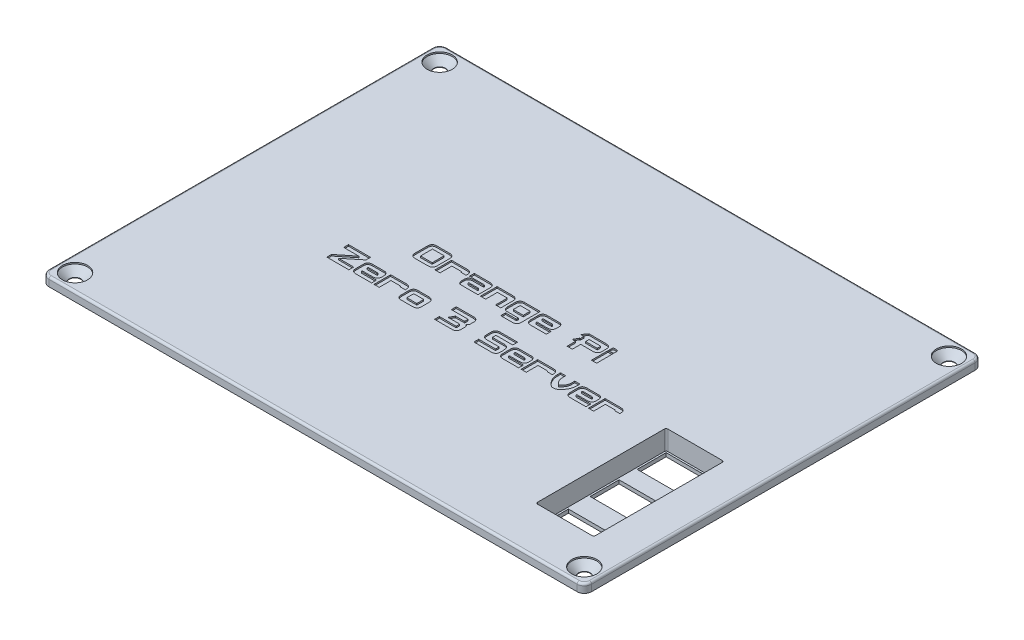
from build123d import *

# Parameters (mm, degrees)
SKETCH1_W                                    = 150
SKETCH1_H                                    = 110
BOSS_EXTRUDE1_DEPTH                          = 2.4
CSK_FOR_M3_HEX_SOCKET_COUNTERSUNK_HE_2_COUNT = 2
CSK_FOR_M3_HEX_SOCKET_COUNTERSUNK_HE_2_PITCH = 173.162582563
CSK_FOR_M3_HEX_SOCKET_COUNTERSUNK_HE_3_COUNT = 2
CSK_FOR_M3_HEX_SOCKET_COUNTERSUNK_HE_3_PITCH = 100.8
CSK_FOR_M3_HEX_SOCKET_COUNTERSUNK_HE_4_COUNT = 2
CSK_FOR_M3_HEX_SOCKET_COUNTERSUNK_HE_4_PITCH = 140.8
FILLET1_R                                    = 2
CUT_EXTRUDE1_DEPTH                           = 0.4
SKETCH7_W                                    = 20.8
SKETCH7_H                                    = 40.8
BOSS_EXTRUDE2_DEPTH                          = 4
SKETCH8_W                                    = 16
SKETCH8_H                                    = 36
CUT_EXTRUDE2_DEPTH                           = 5.4
FILLET2_R                                    = 0.5
SKETCH9_W                                    = 15
SKETCH9_H                                    = 8
CUT_EXTRUDE3_DEPTH                           = 187.120821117
FILLET3_R                                    = 0.5
FILLET5_R                                    = 0.6


with BuildPart() as part:
    # Sketch1 → Boss-Extrude1 (new body)
    with BuildSketch(Plane(origin=(0, 0, 0), x_dir=(1, 0, 0), z_dir=(0, 1, 0))):
        with Locations((75, 55)):
            Rectangle(SKETCH1_W, SKETCH1_H)
    extrude(amount=BOSS_EXTRUDE1_DEPTH)

    # Sketch4 → CSK for M3 Hex Socket Countersunk Head S (revolve, cut)
    with BuildSketch(Plane(origin=(4.6, 2.4, -105.4), x_dir=(0, 0, 1), z_dir=(1, 0, 0))):
        Polygon((0, 0), (0, 50.96137699), (1.6, 50), (1.6, 2.27), (3.47, 0.4), (3.47, 0), align=None)
    csk_for_m3_hex_socket_countersunk_head_s = revolve(axis=Axis((4.6, 8.75, -105.4), (0, -1, 0)), mode=Mode.SUBTRACT)

    # CSK for M3 Hex Socket Countersunk He 2: CSK for M3 Hex Socket Countersunk Head S ×2
    with Locations(*[Vector(0.8131086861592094, 0, 0.5821119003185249) * (i * CSK_FOR_M3_HEX_SOCKET_COUNTERSUNK_HE_2_PITCH) for i in range(1, CSK_FOR_M3_HEX_SOCKET_COUNTERSUNK_HE_2_COUNT)]):
        add(csk_for_m3_hex_socket_countersunk_head_s, mode=Mode.SUBTRACT)

    # CSK for M3 Hex Socket Countersunk He 3: CSK for M3 Hex Socket Countersunk Head S ×2
    with Locations(*[(0, 0, i * CSK_FOR_M3_HEX_SOCKET_COUNTERSUNK_HE_3_PITCH) for i in range(1, CSK_FOR_M3_HEX_SOCKET_COUNTERSUNK_HE_3_COUNT)]):
        add(csk_for_m3_hex_socket_countersunk_head_s, mode=Mode.SUBTRACT)

    # CSK for M3 Hex Socket Countersunk He 4: CSK for M3 Hex Socket Countersunk Head S ×2
    with Locations(*[(i * CSK_FOR_M3_HEX_SOCKET_COUNTERSUNK_HE_4_PITCH, 0, 0) for i in range(1, CSK_FOR_M3_HEX_SOCKET_COUNTERSUNK_HE_4_COUNT)]):
        add(csk_for_m3_hex_socket_countersunk_head_s, mode=Mode.SUBTRACT)

    # Fillet1
    fillet1_edges = [part.edges().sort_by_distance(p)[0] for p in [
        (0, 1.2, -110),
        (150, 1.2, -110),
        (150, 1.2, 0),
        (0, 1.2, 0),
    ]]
    fillet(fillet1_edges, radius=FILLET1_R)

    # Sketch5 → Cut-Extrude1 (cut)
    # profile 1 of 20: a face of its own
    with BuildSketch(Plane(origin=(0, 2.4, 0), x_dir=(1, 0, 0), z_dir=(0, 1, 0))):
        with BuildLine():
            add(Edge.make_bspline(
                [(53.025298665, 56.252283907), (53.02431657, 56.201632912), (53.022410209, 56.103313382), (53.004941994, 55.960931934), (52.978549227, 55.82831569), (52.942534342, 55.705008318), (52.894259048, 55.592174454), (52.836776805, 55.488272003), (52.767236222, 55.395220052), (52.6881135, 55.311528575), (52.598170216, 55.237857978), (52.498368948, 55.172517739), (52.386700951, 55.119959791), (52.26569426, 55.076222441), (52.134760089, 55.040401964), (51.992372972, 55.01821045), (51.840409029, 55.001373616), (51.735587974, 55.000466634), (51.681658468, 55)],
                knots=[0, 0, 0, 0, 1.154766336, 2.241537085, 3.266234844, 4.23644993, 5.165242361, 6.059848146, 6.938161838, 7.807328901, 8.680166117, 9.584103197, 10.520790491, 11.487527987, 12.516506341, 13.610866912, 14.770812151, 16, 16, 16, 16], degree=3))
            Line((51.681658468, 55), (48.189037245, 55))
            add(Edge.make_bspline(
                [(48.189037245, 55), (48.138381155, 55.000439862), (48.040556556, 55.001289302), (47.898902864, 55.018277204), (47.766293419, 55.040485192), (47.643878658, 55.076494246), (47.530502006, 55.11958207), (47.426637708, 55.172978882), (47.333891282, 55.238231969), (47.24994916, 55.31215746), (47.174697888, 55.394841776), (47.111687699, 55.489384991), (47.055887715, 55.591840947), (47.013391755, 55.705805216), (46.977226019, 55.82811152), (46.954838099, 55.961203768), (46.938463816, 56.103368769), (46.936407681, 56.201633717), (46.935347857, 56.252283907)],
                knots=[0, 0, 0, 0, 1.196021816, 2.309699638, 3.367160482, 4.369225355, 5.318990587, 6.230032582, 7.120600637, 7.991198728, 8.869155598, 9.753440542, 10.669646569, 11.619411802, 12.621476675, 13.678937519, 14.803619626, 16, 16, 16, 16], degree=3))
            Line((46.935347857, 56.252283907), (46.935347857, 59.740688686))
            add(Edge.make_bspline(
                [(46.935347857, 59.740688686), (46.935783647, 59.791814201), (46.936625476, 59.890574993), (46.953682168, 60.033611), (46.97558152, 60.167242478), (47.012195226, 60.29039228), (47.05450206, 60.404564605), (47.108802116, 60.50886102), (47.173094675, 60.602725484), (47.247560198, 60.686775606), (47.330199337, 60.762016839), (47.424981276, 60.825483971), (47.528329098, 60.880486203), (47.642523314, 60.923424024), (47.764874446, 60.959528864), (47.897956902, 60.981834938), (48.040096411, 60.998638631), (48.138383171, 60.999537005), (48.189037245, 61)],
                knots=[0, 0, 0, 0, 1.202441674, 2.32279503, 3.387039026, 4.385247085, 5.341647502, 6.249183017, 7.145392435, 8.01263971, 8.887217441, 9.76809889, 10.690519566, 11.636629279, 12.634837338, 13.688228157, 14.808581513, 16, 16, 16, 16], degree=3))
            Line((48.189037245, 61), (51.681658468, 61))
            add(Edge.make_bspline(
                [(51.681658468, 61), (51.736045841, 60.998903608), (51.841301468, 60.996781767), (51.993940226, 60.980963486), (52.136049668, 60.956420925), (52.267399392, 60.920630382), (52.389625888, 60.877994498), (52.500349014, 60.822699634), (52.601393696, 60.759574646), (52.691352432, 60.685547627), (52.769625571, 60.600632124), (52.839539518, 60.507523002), (52.897411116, 60.40393732), (52.943278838, 60.290798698), (52.980223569, 60.168522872), (53.006718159, 60.036332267), (53.021874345, 59.894239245), (53.024137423, 59.796475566), (53.025298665, 59.746310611)],
                knots=[0, 0, 0, 0, 1.239933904, 2.399638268, 3.495595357, 4.524360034, 5.500939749, 6.44211244, 7.34009792, 8.212753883, 9.089519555, 9.967650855, 10.862070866, 11.786544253, 12.7463273, 13.77081227, 14.856148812, 16, 16, 16, 16], degree=3))
            Line((53.025298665, 59.746310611), (53.025298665, 56.252283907))
        make_face()
        with BuildLine():
            add(Edge.make_bspline(
                [(51.59170766, 59.513000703), (51.590182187, 59.534043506), (51.587411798, 59.572259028), (51.557688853, 59.622429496), (51.506277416, 59.652203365), (51.466096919, 59.65489074), (51.444132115, 59.656359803)],
                knots=[0, 0, 0, 0, 1.073381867, 1.949352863, 2.879006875, 4, 4, 4, 4], degree=3))
            Line((51.444132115, 59.656359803), (48.422347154, 59.656359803))
            add(Edge.make_bspline(
                [(48.422347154, 59.656359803), (48.41359904, 59.654045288), (48.394404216, 59.648966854), (48.379899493, 59.613945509), (48.368878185, 59.568423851), (48.368916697, 59.530570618), (48.368938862, 59.508784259)],
                knots=[0, 0, 0, 0, 0.611101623, 1.340859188, 2.469536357, 4, 4, 4, 4], degree=3))
            Line((48.368938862, 59.508784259), (48.368938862, 56.486999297))
            add(Edge.make_bspline(
                [(48.368938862, 56.486999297), (48.368732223, 56.465592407), (48.368378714, 56.428970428), (48.380935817, 56.385195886), (48.393615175, 56.349418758), (48.413550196, 56.345409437), (48.422347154, 56.343640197)],
                knots=[0, 0, 0, 0, 1.528053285, 2.614127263, 3.388439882, 4, 4, 4, 4], degree=3))
            Line((48.422347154, 56.343640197), (51.448348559, 56.343640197))
            add(Edge.make_bspline(
                [(51.448348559, 56.343640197), (51.469777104, 56.34522977), (51.50871674, 56.348118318), (51.560564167, 56.376779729), (51.58880768, 56.429508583), (51.590679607, 56.46934035), (51.59170766, 56.491215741)],
                knots=[0, 0, 0, 0, 1.089337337, 1.979527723, 2.890367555, 4, 4, 4, 4], degree=3))
            Line((51.59170766, 56.491215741), (51.59170766, 59.513000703))
        make_face(mode=Mode.SUBTRACT)
    # profile 2 of 20: a face of its own
    with BuildSketch(Plane(origin=(0, 2.4, 0), x_dir=(1, 0, 0), z_dir=(0, 1, 0))):
        with BuildLine():
            Line((59.304989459, 58.026001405), (57.86718201, 58.026001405))
            add(Edge.make_bspline(
                [(57.86718201, 58.026001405), (57.865969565, 58.060377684), (57.863846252, 58.120579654), (57.841262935, 58.199181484), (57.792870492, 58.252336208), (57.750635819, 58.256980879), (57.729444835, 58.259311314)],
                knots=[0, 0, 0, 0, 1.354770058, 2.372561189, 3.183442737, 4, 4, 4, 4], degree=3))
            Line((57.729444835, 58.259311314), (55.115249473, 58.259311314))
            Line((55.115249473, 58.259311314), (55.115249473, 55))
            Line((55.115249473, 55), (53.691496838, 55))
            Line((53.691496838, 55), (53.681658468, 59.602951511))
            Line((53.681658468, 59.602951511), (57.961349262, 59.602951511))
            add(Edge.make_bspline(
                [(57.961349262, 59.602951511), (58.015748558, 59.602501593), (58.121040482, 59.601630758), (58.273463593, 59.584725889), (58.415876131, 59.562604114), (58.547148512, 59.526425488), (58.668855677, 59.4833255), (58.780857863, 59.430397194), (58.880673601, 59.36510166), (58.970620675, 59.29142495), (59.049714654, 59.207715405), (59.119614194, 59.114414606), (59.176694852, 59.009953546), (59.223323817, 58.896214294), (59.259642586, 58.773261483), (59.286461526, 58.64070638), (59.301603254, 58.498125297), (59.303837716, 58.399894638), (59.304989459, 58.349262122)],
                knots=[0, 0, 0, 0, 1.237956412, 2.396112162, 3.488784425, 4.516175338, 5.491450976, 6.42669321, 7.329235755, 8.200726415, 9.068552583, 9.94551127, 10.848053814, 11.771292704, 12.740011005, 13.763127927, 14.847015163, 16, 16, 16, 16], degree=3))
            Line((59.304989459, 58.349262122), (59.304989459, 58.026001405))
        make_face()
    # profile 3 of 20: a face of its own
    with BuildSketch(Plane(origin=(0, 2.4, 0), x_dir=(1, 0, 0), z_dir=(0, 1, 0))):
        with BuildLine():
            Line((64.167955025, 57.973998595), (64.167955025, 58.115952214))
            add(Edge.make_bspline(
                [(64.167955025, 58.115952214), (64.166969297, 58.137416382), (64.16517551, 58.176475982), (64.136272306, 58.227627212), (64.08554721, 58.256303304), (64.046982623, 58.258251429), (64.026001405, 58.259311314)],
                knots=[0, 0, 0, 0, 1.10567881, 2.012068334, 2.918457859, 4, 4, 4, 4], degree=3))
            Line((64.026001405, 58.259311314), (59.978215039, 58.259311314))
            Line((59.978215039, 58.259311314), (59.978215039, 59.602951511))
            Line((59.978215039, 59.602951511), (64.257905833, 59.602951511))
            add(Edge.make_bspline(
                [(64.257905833, 59.602951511), (64.311835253, 59.602478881), (64.416656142, 59.601560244), (64.568161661, 59.584856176), (64.710091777, 59.562482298), (64.840777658, 59.526213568), (64.962810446, 59.484181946), (65.072550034, 59.42794353), (65.1740397, 59.3656046), (65.262343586, 59.289744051), (65.342679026, 59.206348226), (65.411074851, 59.11194665), (65.469673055, 59.007755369), (65.516601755, 58.893767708), (65.555548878, 58.77031125), (65.58085254, 58.636778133), (65.598792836, 58.49357156), (65.600607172, 58.394767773), (65.60154603, 58.343640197)],
                knots=[0, 0, 0, 0, 1.226244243, 2.383411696, 3.464641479, 4.491155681, 5.465599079, 6.395166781, 7.291187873, 8.168758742, 9.035844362, 9.920636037, 10.813099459, 11.749487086, 12.72048463, 13.75317872, 14.837346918, 16, 16, 16, 16], degree=3))
            Line((65.60154603, 58.343640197), (65.60154603, 55))
            Line((65.60154603, 55), (61, 55))
            add(Edge.make_bspline(
                [(61, 55), (60.958702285, 55.000455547), (60.878600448, 55.001339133), (60.762673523, 55.018302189), (60.653779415, 55.040608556), (60.553811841, 55.076614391), (60.461198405, 55.120303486), (60.375873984, 55.173598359), (60.30021548, 55.23895022), (60.231835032, 55.312984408), (60.171174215, 55.396272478), (60.118548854, 55.490058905), (60.076278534, 55.594410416), (60.038385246, 55.707125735), (60.013616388, 55.830563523), (59.991072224, 55.962499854), (59.981026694, 56.105025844), (59.979172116, 56.203084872), (59.978215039, 56.253689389)],
                knots=[0, 0, 0, 0, 1.070310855, 2.075995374, 3.034513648, 3.949497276, 4.824866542, 5.688168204, 6.55044233, 7.4106577, 8.29809697, 9.217832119, 10.193083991, 11.215597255, 12.298056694, 13.455135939, 14.686692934, 16, 16, 16, 16], degree=3))
            Line((59.978215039, 56.253689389), (59.978215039, 56.718903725))
            add(Edge.make_bspline(
                [(59.978215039, 56.718903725), (59.978683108, 56.769556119), (59.979591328, 56.867839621), (59.996325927, 57.010001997), (60.018947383, 57.143449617), (60.054423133, 57.266492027), (60.097853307, 57.380216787), (60.15109163, 57.48420449), (60.216995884, 57.576829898), (60.289388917, 57.662258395), (60.373658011, 57.735841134), (60.467754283, 57.799581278), (60.571222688, 57.854457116), (60.685382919, 57.89743056), (60.807743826, 57.933525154), (60.940823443, 57.955834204), (61.08296377, 57.97263704), (61.181250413, 57.973535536), (61.231904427, 57.973998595)],
                knots=[0, 0, 0, 0, 1.1936312, 2.316065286, 3.371412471, 4.3820972, 5.329964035, 6.239185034, 7.127973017, 8.005149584, 8.874007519, 9.756524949, 10.680658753, 11.628525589, 12.628587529, 13.683934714, 14.8063688, 16, 16, 16, 16], degree=3))
            Line((61.231904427, 57.973998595), (64.167955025, 57.973998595))
        make_face()
        with BuildLine():
            add(Edge.make_bspline(
                [(61.465214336, 56.628952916), (61.456449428, 56.627176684), (61.437010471, 56.623237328), (61.42309225, 56.588183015), (61.41170967, 56.544395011), (61.411770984, 56.507878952), (61.411806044, 56.486999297)],
                knots=[0, 0, 0, 0, 0.616267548, 1.36676831, 2.494334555, 4, 4, 4, 4], degree=3))
            add(Edge.make_bspline(
                [(61.411806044, 56.486999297), (61.411599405, 56.465592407), (61.411245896, 56.428970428), (61.423802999, 56.385195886), (61.436482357, 56.349418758), (61.456417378, 56.345409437), (61.465214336, 56.343640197)],
                knots=[0, 0, 0, 0, 1.528053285, 2.614127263, 3.388439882, 4, 4, 4, 4], degree=3))
            Line((61.465214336, 56.343640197), (64.026001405, 56.343640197))
            add(Edge.make_bspline(
                [(64.026001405, 56.343640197), (64.047086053, 56.344555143), (64.086087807, 56.346247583), (64.135379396, 56.376766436), (64.165597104, 56.426577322), (64.16711318, 56.465426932), (64.167955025, 56.486999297)],
                knots=[0, 0, 0, 0, 1.08375889, 2.004704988, 2.892054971, 4, 4, 4, 4], degree=3))
            Line((64.167955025, 56.486999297), (64.167955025, 56.628952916))
            Line((64.167955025, 56.628952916), (61.465214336, 56.628952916))
        make_face(mode=Mode.SUBTRACT)
    # profile 4 of 20: a face of its own
    with BuildSketch(Plane(origin=(0, 2.4, 0), x_dir=(1, 0, 0), z_dir=(0, 1, 0))):
        with BuildLine():
            Line((71.8981026, 55), (70.460295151, 55))
            Line((70.460295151, 55), (70.460295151, 58.115952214))
            add(Edge.make_bspline(
                [(70.460295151, 58.115952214), (70.459171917, 58.137347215), (70.457140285, 58.176045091), (70.430310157, 58.227449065), (70.380778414, 58.256338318), (70.343076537, 58.258263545), (70.322557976, 58.259311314)],
                knots=[0, 0, 0, 0, 1.12171091, 2.028877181, 2.927252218, 4, 4, 4, 4], degree=3))
            Line((70.322557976, 58.259311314), (67.708362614, 58.259311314))
            Line((67.708362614, 58.259311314), (67.708362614, 55))
            Line((67.708362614, 55), (66.274771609, 55))
            Line((66.274771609, 55), (66.274771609, 59.602951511))
            Line((66.274771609, 59.602951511), (70.554462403, 59.602951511))
            add(Edge.make_bspline(
                [(70.554462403, 59.602951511), (70.608861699, 59.602501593), (70.714153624, 59.601630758), (70.866576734, 59.584725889), (71.008989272, 59.562604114), (71.140261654, 59.526425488), (71.261968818, 59.4833255), (71.373971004, 59.430397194), (71.473786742, 59.36510166), (71.563733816, 59.29142495), (71.642827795, 59.207715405), (71.712727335, 59.114414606), (71.769807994, 59.009953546), (71.816436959, 58.896214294), (71.852755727, 58.773261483), (71.879574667, 58.64070638), (71.894716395, 58.498125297), (71.896950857, 58.399894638), (71.8981026, 58.349262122)],
                knots=[0, 0, 0, 0, 1.237956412, 2.396112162, 3.488784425, 4.516175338, 5.491450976, 6.42669321, 7.329235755, 8.200726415, 9.068552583, 9.94551127, 10.848053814, 11.771292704, 12.740011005, 13.763127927, 14.847015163, 16, 16, 16, 16], degree=3))
            Line((71.8981026, 58.349262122), (71.8981026, 55))
        make_face()
    # profile 5 of 20: a face of its own
    with BuildSketch(Plane(origin=(0, 2.4, 0), x_dir=(1, 0, 0), z_dir=(0, 1, 0))):
        with BuildLine():
            add(Edge.make_bspline(
                [(73.708362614, 55), (73.662389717, 55.000477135), (73.572971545, 55.001405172), (73.443907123, 55.018080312), (73.322963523, 55.040620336), (73.211851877, 55.076730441), (73.108570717, 55.119538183), (73.014243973, 55.173450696), (72.930246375, 55.238839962), (72.853192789, 55.311839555), (72.786925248, 55.396094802), (72.728737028, 55.489776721), (72.679769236, 55.593568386), (72.641168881, 55.707534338), (72.607471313, 55.829654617), (72.588473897, 55.962798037), (72.572961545, 56.104814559), (72.57188386, 56.203041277), (72.57132818, 56.253689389)],
                knots=[0, 0, 0, 0, 1.136149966, 2.209833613, 3.214314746, 4.174506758, 5.093540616, 5.976051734, 6.852148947, 7.720857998, 8.594960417, 9.495321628, 10.44390607, 11.426082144, 12.468867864, 13.571915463, 14.748019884, 16, 16, 16, 16], degree=3))
            Line((72.57132818, 56.253689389), (72.57132818, 58.356289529))
            add(Edge.make_bspline(
                [(72.57132818, 58.356289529), (72.576716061, 58.406517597), (72.587241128, 58.504636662), (72.614278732, 58.645858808), (72.647765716, 58.778034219), (72.689678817, 58.900439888), (72.740256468, 59.013494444), (72.799097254, 59.116184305), (72.866114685, 59.208883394), (72.940585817, 59.292284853), (73.024109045, 59.36586008), (73.11583041, 59.429177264), (73.21547811, 59.482777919), (73.322335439, 59.528446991), (73.438176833, 59.561538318), (73.561464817, 59.58494212), (73.69245738, 59.601507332), (73.782798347, 59.602461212), (73.829234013, 59.602951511)],
                knots=[0, 0, 0, 0, 1.21733433, 2.378027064, 3.46277135, 4.502117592, 5.492896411, 6.444068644, 7.349977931, 8.245692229, 9.13389891, 10.026760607, 10.926311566, 11.857630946, 12.822582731, 13.823735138, 14.881390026, 16, 16, 16, 16], degree=3))
            Line((73.829234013, 59.602951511), (78.200281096, 59.602951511))
            Line((78.200281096, 59.602951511), (78.200281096, 54.390021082))
            add(Edge.make_bspline(
                [(78.200281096, 54.390021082), (78.19929988, 54.339369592), (78.197395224, 54.241049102), (78.179915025, 54.098674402), (78.153563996, 53.966034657), (78.117404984, 53.842808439), (78.06954321, 53.729477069), (78.010120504, 53.626398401), (77.940863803, 53.532959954), (77.861601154, 53.448793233), (77.770456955, 53.376006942), (77.670856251, 53.310621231), (77.559617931, 53.257044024), (77.437798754, 53.214062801), (77.305961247, 53.178289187), (77.163142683, 53.155923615), (77.0107076, 53.139068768), (76.905417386, 53.138190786), (76.851018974, 53.137737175)],
                knots=[0, 0, 0, 0, 1.152247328, 2.236647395, 3.259109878, 4.227208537, 5.1539749, 6.051898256, 6.928295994, 7.795567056, 8.674748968, 9.576714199, 10.501761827, 11.476413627, 12.513447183, 13.605420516, 14.76283545, 16, 16, 16, 16], degree=3))
            Line((76.851018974, 53.137737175), (73.73506676, 53.137737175))
            Line((73.73506676, 53.137737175), (73.739283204, 54.481377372))
            Line((73.739283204, 54.481377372), (76.619114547, 54.481377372))
            add(Edge.make_bspline(
                [(76.619114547, 54.481377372), (76.640199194, 54.482292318), (76.679200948, 54.483984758), (76.728492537, 54.514503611), (76.758710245, 54.564314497), (76.760226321, 54.603164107), (76.761068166, 54.624736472)],
                knots=[0, 0, 0, 0, 1.08375889, 2.004704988, 2.892054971, 4, 4, 4, 4], degree=3))
            Line((76.761068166, 54.624736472), (76.761068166, 55))
            Line((76.761068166, 55), (73.708362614, 55))
        make_face()
        with BuildLine():
            Line((76.766690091, 58.259311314), (74.058327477, 58.259311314))
            add(Edge.make_bspline(
                [(74.058327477, 58.259311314), (74.049562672, 58.257535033), (74.030123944, 58.253595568), (74.016203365, 58.21854238), (74.004721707, 58.174304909), (74.004846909, 58.13730904), (74.004919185, 58.115952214)],
                knots=[0, 0, 0, 0, 0.611050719, 1.35519834, 2.473219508, 4, 4, 4, 4], degree=3))
            Line((74.004919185, 58.115952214), (74.003513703, 56.481377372))
            add(Edge.make_bspline(
                [(74.003513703, 56.481377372), (74.004125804, 56.461038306), (74.005178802, 56.426048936), (74.015789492, 56.382451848), (74.033221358, 56.349379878), (74.053418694, 56.345426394), (74.062543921, 56.343640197)],
                knots=[0, 0, 0, 0, 1.484465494, 2.553731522, 3.346570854, 4, 4, 4, 4], degree=3))
            Line((74.062543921, 56.343640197), (76.766690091, 56.343640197))
            Line((76.766690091, 56.343640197), (76.766690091, 58.259311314))
        make_face(mode=Mode.SUBTRACT)
    # profile 6 of 20: a face of its own
    with BuildSketch(Plane(origin=(0, 2.4, 0), x_dir=(1, 0, 0), z_dir=(0, 1, 0))):
        with BuildLine():
            Line((80.301475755, 56.628952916), (80.301475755, 56.486999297))
            add(Edge.make_bspline(
                [(80.301475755, 56.486999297), (80.301269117, 56.465592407), (80.300915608, 56.428970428), (80.313472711, 56.385195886), (80.326152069, 56.349418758), (80.34608709, 56.345409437), (80.354884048, 56.343640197)],
                knots=[0, 0, 0, 0, 1.528053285, 2.614127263, 3.388439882, 4, 4, 4, 4], degree=3))
            Line((80.354884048, 56.343640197), (84.491215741, 56.343640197))
            Line((84.491215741, 56.343640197), (84.491215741, 55))
            Line((84.491215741, 55), (80.121574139, 55))
            add(Edge.make_bspline(
                [(80.121574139, 55), (80.071385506, 55.000450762), (79.974027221, 55.001325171), (79.83286595, 55.018337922), (79.700609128, 55.040203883), (79.578923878, 55.076922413), (79.465339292, 55.11910258), (79.362892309, 55.174941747), (79.268353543, 55.237945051), (79.18564333, 55.313186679), (79.111816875, 55.397174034), (79.045941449, 55.490084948), (78.993849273, 55.59521332), (78.948011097, 55.708127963), (78.913113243, 55.831168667), (78.888529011, 55.964362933), (78.870737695, 56.107051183), (78.86885175, 56.205844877), (78.867884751, 56.256500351)],
                knots=[0, 0, 0, 0, 1.184477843, 2.297706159, 3.354740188, 4.345770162, 5.295152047, 6.210988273, 7.0949163, 7.972518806, 8.842765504, 9.732974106, 10.653477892, 11.606913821, 12.608574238, 13.667633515, 14.804102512, 16, 16, 16, 16], degree=3))
            Line((78.867884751, 56.256500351), (78.867884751, 58.349262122))
            add(Edge.make_bspline(
                [(78.867884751, 58.349262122), (78.868347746, 58.399916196), (78.86924612, 58.498202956), (78.886049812, 58.640342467), (78.908355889, 58.773424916), (78.944460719, 58.895776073), (78.987398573, 59.0099702), (79.04240069, 59.11331834), (79.105868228, 59.208099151), (79.181107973, 59.290742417), (79.265163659, 59.365192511), (79.35900663, 59.429544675), (79.46299711, 59.483412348), (79.576818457, 59.526716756), (79.699833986, 59.562217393), (79.833743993, 59.58495706), (79.976394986, 59.60150296), (80.075140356, 59.602460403), (80.125790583, 59.602951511)],
                knots=[0, 0, 0, 0, 1.192208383, 2.313304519, 3.367393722, 4.36626358, 5.313000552, 6.236032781, 7.117498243, 7.992655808, 8.860478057, 9.75728165, 10.66541885, 11.612155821, 12.621635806, 13.675725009, 14.807791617, 16, 16, 16, 16], degree=3))
            Line((80.125790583, 59.602951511), (83.380885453, 59.602951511))
            add(Edge.make_bspline(
                [(83.380885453, 59.602951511), (83.42592432, 59.602497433), (83.513015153, 59.601619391), (83.638798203, 59.584800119), (83.75687824, 59.562094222), (83.865819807, 59.5265108), (83.966738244, 59.483431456), (84.058398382, 59.429056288), (84.140796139, 59.364125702), (84.216427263, 59.291048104), (84.281227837, 59.206782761), (84.338178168, 59.113141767), (84.385039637, 59.0089813), (84.425262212, 58.895929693), (84.453486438, 58.772634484), (84.476771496, 58.640484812), (84.488838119, 58.49799847), (84.490406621, 58.399878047), (84.491215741, 58.349262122)],
                knots=[0, 0, 0, 0, 1.125166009, 2.175712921, 3.168223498, 4.127761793, 5.035334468, 5.907277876, 6.783695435, 7.653511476, 8.529929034, 9.434017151, 10.388033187, 11.38095849, 12.429413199, 13.546438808, 14.734317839, 16, 16, 16, 16], degree=3))
            Line((84.491215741, 58.349262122), (84.491215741, 57.884047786))
            add(Edge.make_bspline(
                [(84.491215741, 57.884047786), (84.490060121, 57.833416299), (84.487818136, 57.735187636), (84.472729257, 57.592592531), (84.445636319, 57.459645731), (84.40977577, 57.336105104), (84.363267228, 57.222222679), (84.30547237, 57.118614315), (84.235538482, 57.025510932), (84.157270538, 56.940594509), (84.067310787, 56.866565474), (83.966264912, 56.803449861), (83.855547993, 56.748117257), (83.733296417, 56.705631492), (83.602125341, 56.669255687), (83.459683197, 56.647191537), (83.307268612, 56.630270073), (83.201975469, 56.62940161), (83.147575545, 56.628952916)],
                knots=[0, 0, 0, 0, 1.15243773, 2.235810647, 3.258442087, 4.236922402, 5.159723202, 6.052524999, 6.929067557, 7.804246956, 8.675324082, 9.571684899, 10.511154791, 11.485967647, 12.51287105, 13.605024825, 14.762631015, 16, 16, 16, 16], degree=3))
            Line((83.147575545, 56.628952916), (80.301475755, 56.628952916))
        make_face()
        with BuildLine():
            add(Edge.make_bspline(
                [(82.915671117, 57.973998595), (82.936652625, 57.975058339), (82.975217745, 57.977006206), (83.025939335, 58.005683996), (83.054617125, 58.056405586), (83.056564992, 58.094970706), (83.057624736, 58.115952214)],
                knots=[0, 0, 0, 0, 1.088107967, 2, 2.911892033, 4, 4, 4, 4], degree=3))
            add(Edge.make_bspline(
                [(83.057624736, 58.115952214), (83.056639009, 58.137416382), (83.054845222, 58.176475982), (83.025942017, 58.227627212), (82.975216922, 58.256303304), (82.936652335, 58.258251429), (82.915671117, 58.259311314)],
                knots=[0, 0, 0, 0, 1.10567881, 2.012068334, 2.918457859, 4, 4, 4, 4], degree=3))
            Line((82.915671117, 58.259311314), (80.354884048, 58.259311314))
            add(Edge.make_bspline(
                [(80.354884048, 58.259311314), (80.346119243, 58.257535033), (80.326680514, 58.253595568), (80.312759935, 58.21854238), (80.301278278, 58.174304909), (80.301403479, 58.13730904), (80.301475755, 58.115952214)],
                knots=[0, 0, 0, 0, 0.611050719, 1.35519834, 2.473219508, 4, 4, 4, 4], degree=3))
            Line((80.301475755, 58.115952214), (80.301475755, 57.973998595))
            Line((80.301475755, 57.973998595), (82.915671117, 57.973998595))
        make_face(mode=Mode.SUBTRACT)
    # profile 7 of 20: a face of its own
    with BuildSketch(Plane(origin=(0, 2.4, 0), x_dir=(1, 0, 0), z_dir=(0, 1, 0))):
        with BuildLine():
            add(Edge.make_bspline(
                [(96.322557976, 58.576950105), (96.321430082, 58.526314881), (96.319252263, 58.428544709), (96.303893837, 58.286461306), (96.27724048, 58.154344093), (96.240821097, 58.031442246), (96.194660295, 57.917908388), (96.136734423, 57.81439669), (96.067351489, 57.721253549), (95.988114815, 57.637700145), (95.898671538, 57.563722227), (95.797957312, 57.500295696), (95.686492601, 57.446996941), (95.564697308, 57.404033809), (95.433450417, 57.367815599), (95.29103043, 57.345705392), (95.138609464, 57.328797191), (95.033317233, 57.327926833), (94.978917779, 57.327477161)],
                knots=[0, 0, 0, 0, 1.154838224, 2.229845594, 3.254607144, 4.22488263, 5.149605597, 6.044267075, 6.922635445, 7.791856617, 8.664748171, 9.562976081, 10.499721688, 11.47656505, 12.505607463, 13.600036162, 14.760053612, 16, 16, 16, 16], degree=3))
            Line((94.978917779, 57.327477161), (91.667603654, 57.327477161))
            Line((91.667603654, 57.327477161), (91.667603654, 55))
            Line((91.667603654, 55), (90.242445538, 55))
            Line((90.242445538, 55), (90.234012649, 57.333099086))
            Line((90.234012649, 57.333099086), (89.302178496, 57.333099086))
            Line((89.302178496, 57.333099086), (90.044272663, 58.666900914))
            Line((90.044272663, 58.666900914), (90.234012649, 58.666900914))
            Line((90.234012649, 58.666900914), (90.234012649, 59.650737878))
            Line((90.234012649, 59.650737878), (89.302178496, 59.656359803))
            Line((89.302178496, 59.656359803), (90.284609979, 61))
            Line((90.284609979, 61), (94.978917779, 61))
            add(Edge.make_bspline(
                [(94.978917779, 61), (95.033317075, 60.999550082), (95.138609, 60.998679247), (95.29103211, 60.981774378), (95.433444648, 60.959652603), (95.56471703, 60.923473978), (95.686424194, 60.88037399), (95.79842638, 60.827445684), (95.898242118, 60.762150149), (95.988189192, 60.688473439), (96.067283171, 60.604763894), (96.137182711, 60.511463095), (96.194263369, 60.407002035), (96.240892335, 60.293262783), (96.277211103, 60.170309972), (96.304030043, 60.037754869), (96.319171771, 59.895173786), (96.321406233, 59.796943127), (96.322557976, 59.746310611)],
                knots=[0, 0, 0, 0, 1.237956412, 2.396112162, 3.488784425, 4.516175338, 5.491450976, 6.42669321, 7.329235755, 8.200726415, 9.068552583, 9.94551127, 10.848053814, 11.771292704, 12.740011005, 13.763127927, 14.847015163, 16, 16, 16, 16], degree=3))
            Line((96.322557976, 59.746310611), (96.322557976, 58.576950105))
        make_face()
        with BuildLine():
            add(Edge.make_bspline(
                [(94.888966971, 59.508784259), (94.887785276, 59.530198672), (94.885625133, 59.56934429), (94.859281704, 59.62036314), (94.812633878, 59.65249879), (94.775672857, 59.654994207), (94.75544624, 59.656359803)],
                knots=[0, 0, 0, 0, 1.129342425, 2.064441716, 2.94078152, 4, 4, 4, 4], degree=3))
            Line((94.75544624, 59.656359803), (91.667603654, 59.656359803))
            Line((91.667603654, 59.656359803), (91.667603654, 58.666900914))
            Line((91.667603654, 58.666900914), (94.744202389, 58.665495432))
            add(Edge.make_bspline(
                [(94.744202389, 58.665495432), (94.765867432, 58.666776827), (94.805740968, 58.669135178), (94.854977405, 58.702000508), (94.886956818, 58.752258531), (94.888252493, 58.792362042), (94.888966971, 58.814476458)],
                knots=[0, 0, 0, 0, 1.084687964, 1.996319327, 2.895103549, 4, 4, 4, 4], degree=3))
            Line((94.888966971, 58.814476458), (94.888966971, 59.508784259))
        make_face(mode=Mode.SUBTRACT)
    # profile 8 of 20: a face of its own
    with BuildSketch(Plane(origin=(0, 2.4, 0), x_dir=(1, 0, 0), z_dir=(0, 1, 0))):
        Polygon((98.381588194, 55), (96.952213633, 55), (96.947997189, 59.602951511), (98.381588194, 59.602951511), align=None)
    # profile 9 of 20: a face of its own
    with BuildSketch(Plane(origin=(0, 2.4, 0), x_dir=(1, 0, 0), z_dir=(0, 1, 0))):
        with BuildLine():
            add(Edge.make_bspline(
                [(97.853127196, 61), (97.894457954, 60.998832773), (97.972573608, 60.996626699), (98.081179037, 60.975753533), (98.174073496, 60.942274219), (98.250922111, 60.894193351), (98.310298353, 60.829905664), (98.353746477, 60.752172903), (98.376882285, 60.659748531), (98.379967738, 60.594403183), (98.381588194, 60.560084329)],
                knots=[0, 0, 0, 0, 1.260767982, 2.38286745, 3.360563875, 4.261251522, 5.121505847, 6.005108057, 6.952298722, 8, 8, 8, 8], degree=3))
            Line((98.381588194, 60.560084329), (98.381588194, 60.094869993))
            add(Edge.make_bspline(
                [(98.381588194, 60.094869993), (98.380025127, 60.060536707), (98.377069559, 59.995616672), (98.353440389, 59.90380748), (98.3103194, 59.826449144), (98.250916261, 59.762167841), (98.174075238, 59.714085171), (98.081178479, 59.680606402), (97.972573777, 59.659733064), (97.894458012, 59.657527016), (97.853127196, 59.656359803)],
                knots=[0, 0, 0, 0, 1.049513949, 1.984502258, 2.869633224, 3.731375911, 4.633621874, 5.613009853, 6.737050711, 8, 8, 8, 8], degree=3))
            Line((97.853127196, 59.656359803), (97.386507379, 59.656359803))
            add(Edge.make_bspline(
                [(97.386507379, 59.656359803), (97.352161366, 59.657464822), (97.287416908, 59.659547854), (97.197157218, 59.681366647), (97.119190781, 59.714357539), (97.055216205, 59.76357882), (97.005994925, 59.827553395), (96.973004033, 59.905519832), (96.95118524, 59.995779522), (96.949102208, 60.06052398), (96.947997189, 60.094869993)],
                knots=[0, 0, 0, 0, 1.158543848, 2.183930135, 3.119573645, 4, 4.880426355, 5.816069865, 6.841456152, 8, 8, 8, 8], degree=3))
            Line((96.947997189, 60.094869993), (96.947997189, 60.560084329))
            add(Edge.make_bspline(
                [(96.947997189, 60.560084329), (96.949154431, 60.594418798), (96.951351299, 60.659598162), (96.972747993, 60.750434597), (97.006013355, 60.828802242), (97.055211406, 60.892782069), (97.119192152, 60.942001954), (97.197156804, 60.974993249), (97.287417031, 60.996811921), (97.352161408, 60.998894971), (97.386507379, 61)],
                knots=[0, 0, 0, 0, 1.1563166, 2.195111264, 3.128956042, 4.007689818, 4.886423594, 5.820268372, 6.8436834, 8, 8, 8, 8], degree=3))
            Line((97.386507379, 61), (97.853127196, 61))
        make_face()
    # profile 10 of 20: a face of its own
    with BuildSketch(Plane(origin=(0, 2.4, 0), x_dir=(1, 0, 0), z_dir=(0, 1, 0))):
        Polygon((37.590302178, 44.45959241), (41.781447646, 44.45959241), (41.781447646, 43.115952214), (35.691496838, 43.115952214), (35.691496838, 44.411806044), (39.881236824, 47.766690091), (35.691496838, 47.766690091), (35.691496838, 49.115952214), (41.781447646, 49.110330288), (41.77582572, 47.842586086), align=None)
    # profile 11 of 20: a face of its own
    with BuildSketch(Plane(origin=(0, 2.4, 0), x_dir=(1, 0, 0), z_dir=(0, 1, 0))):
        with BuildLine():
            Line((43.871398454, 44.74490513), (43.871398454, 44.602951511))
            add(Edge.make_bspline(
                [(43.871398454, 44.602951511), (43.871191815, 44.581544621), (43.870838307, 44.544922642), (43.88339541, 44.5011481), (43.896074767, 44.465370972), (43.916009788, 44.46136165), (43.924806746, 44.45959241)],
                knots=[0, 0, 0, 0, 1.528053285, 2.614127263, 3.388439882, 4, 4, 4, 4], degree=3))
            Line((43.924806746, 44.45959241), (48.06113844, 44.45959241))
            Line((48.06113844, 44.45959241), (48.06113844, 43.115952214))
            Line((48.06113844, 43.115952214), (43.691496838, 43.115952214))
            add(Edge.make_bspline(
                [(43.691496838, 43.115952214), (43.641308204, 43.116402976), (43.543949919, 43.117277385), (43.402788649, 43.134290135), (43.270531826, 43.156156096), (43.148846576, 43.192874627), (43.03526199, 43.235054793), (42.932815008, 43.29089396), (42.838276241, 43.353897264), (42.755566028, 43.429138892), (42.681739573, 43.513126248), (42.615864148, 43.606037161), (42.563771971, 43.711165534), (42.517933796, 43.824080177), (42.483035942, 43.94712088), (42.458451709, 44.080315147), (42.440660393, 44.223003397), (42.438774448, 44.321797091), (42.437807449, 44.372452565)],
                knots=[0, 0, 0, 0, 1.184477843, 2.297706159, 3.354740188, 4.345770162, 5.295152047, 6.210988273, 7.0949163, 7.972518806, 8.842765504, 9.732974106, 10.653477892, 11.606913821, 12.608574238, 13.667633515, 14.804102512, 16, 16, 16, 16], degree=3))
            Line((42.437807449, 44.372452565), (42.437807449, 46.465214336))
            add(Edge.make_bspline(
                [(42.437807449, 46.465214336), (42.438270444, 46.51586841), (42.439168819, 46.614155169), (42.455972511, 46.756294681), (42.478278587, 46.88937713), (42.514383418, 47.011728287), (42.557321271, 47.125922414), (42.612323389, 47.229270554), (42.675790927, 47.324051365), (42.751030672, 47.406694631), (42.835086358, 47.481144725), (42.928929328, 47.545496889), (43.032919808, 47.599364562), (43.146741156, 47.64266897), (43.269756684, 47.678169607), (43.403666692, 47.700909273), (43.546317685, 47.717455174), (43.645063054, 47.718412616), (43.695713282, 47.718903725)],
                knots=[0, 0, 0, 0, 1.192208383, 2.313304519, 3.367393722, 4.36626358, 5.313000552, 6.236032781, 7.117498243, 7.992655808, 8.860478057, 9.75728165, 10.66541885, 11.612155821, 12.621635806, 13.675725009, 14.807791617, 16, 16, 16, 16], degree=3))
            Line((43.695713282, 47.718903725), (46.950808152, 47.718903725))
            add(Edge.make_bspline(
                [(46.950808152, 47.718903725), (46.995847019, 47.718449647), (47.082937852, 47.717571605), (47.208720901, 47.700752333), (47.326800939, 47.678046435), (47.435742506, 47.642463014), (47.536660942, 47.599383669), (47.62832108, 47.545008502), (47.710718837, 47.480077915), (47.786349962, 47.407000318), (47.851150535, 47.322734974), (47.908100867, 47.229093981), (47.954962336, 47.124933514), (47.995184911, 47.011881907), (48.023409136, 46.888586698), (48.046694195, 46.756437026), (48.058760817, 46.613950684), (48.06032932, 46.515830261), (48.06113844, 46.465214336)],
                knots=[0, 0, 0, 0, 1.125166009, 2.175712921, 3.168223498, 4.127761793, 5.035334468, 5.907277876, 6.783695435, 7.653511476, 8.529929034, 9.434017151, 10.388033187, 11.38095849, 12.429413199, 13.546438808, 14.734317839, 16, 16, 16, 16], degree=3))
            Line((48.06113844, 46.465214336), (48.06113844, 46))
            add(Edge.make_bspline(
                [(48.06113844, 46), (48.059982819, 45.949368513), (48.057740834, 45.85113985), (48.042651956, 45.708544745), (48.015559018, 45.575597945), (47.979698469, 45.452057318), (47.933189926, 45.338174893), (47.875395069, 45.234566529), (47.80546118, 45.141463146), (47.727193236, 45.056546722), (47.637233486, 44.982517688), (47.536187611, 44.919402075), (47.425470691, 44.864069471), (47.303219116, 44.821583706), (47.17204804, 44.785207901), (47.029605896, 44.76314375), (46.877191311, 44.746222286), (46.771898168, 44.745353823), (46.717498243, 44.74490513)],
                knots=[0, 0, 0, 0, 1.15243773, 2.235810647, 3.258442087, 4.236922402, 5.159723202, 6.052524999, 6.929067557, 7.804246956, 8.675324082, 9.571684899, 10.511154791, 11.485967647, 12.51287105, 13.605024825, 14.762631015, 16, 16, 16, 16], degree=3))
            Line((46.717498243, 44.74490513), (43.871398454, 44.74490513))
        make_face()
        with BuildLine():
            add(Edge.make_bspline(
                [(46.485593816, 46.089950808), (46.506575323, 46.091010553), (46.545140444, 46.092958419), (46.595862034, 46.12163621), (46.624539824, 46.172357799), (46.62648769, 46.21092292), (46.627547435, 46.231904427)],
                knots=[0, 0, 0, 0, 1.088107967, 2, 2.911892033, 4, 4, 4, 4], degree=3))
            add(Edge.make_bspline(
                [(46.627547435, 46.231904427), (46.626561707, 46.253368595), (46.62476792, 46.292428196), (46.595864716, 46.343579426), (46.54513962, 46.372255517), (46.506575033, 46.374203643), (46.485593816, 46.375263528)],
                knots=[0, 0, 0, 0, 1.10567881, 2.012068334, 2.918457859, 4, 4, 4, 4], degree=3))
            Line((46.485593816, 46.375263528), (43.924806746, 46.375263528))
            add(Edge.make_bspline(
                [(43.924806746, 46.375263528), (43.916041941, 46.373487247), (43.896603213, 46.369547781), (43.882682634, 46.334494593), (43.871200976, 46.290257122), (43.871326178, 46.253261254), (43.871398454, 46.231904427)],
                knots=[0, 0, 0, 0, 0.611050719, 1.35519834, 2.473219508, 4, 4, 4, 4], degree=3))
            Line((43.871398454, 46.231904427), (43.871398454, 46.089950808))
            Line((43.871398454, 46.089950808), (46.485593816, 46.089950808))
        make_face(mode=Mode.SUBTRACT)
    # profile 12 of 20: a face of its own
    with BuildSketch(Plane(origin=(0, 2.4, 0), x_dir=(1, 0, 0), z_dir=(0, 1, 0))):
        with BuildLine():
            Line((54.357695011, 46.141953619), (52.919887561, 46.141953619))
            add(Edge.make_bspline(
                [(52.919887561, 46.141953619), (52.918675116, 46.176329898), (52.916551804, 46.236531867), (52.893968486, 46.315133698), (52.845576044, 46.368288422), (52.80334137, 46.372933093), (52.782150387, 46.375263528)],
                knots=[0, 0, 0, 0, 1.354770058, 2.372561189, 3.183442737, 4, 4, 4, 4], degree=3))
            Line((52.782150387, 46.375263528), (50.167955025, 46.375263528))
            Line((50.167955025, 46.375263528), (50.167955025, 43.115952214))
            Line((50.167955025, 43.115952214), (48.744202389, 43.115952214))
            Line((48.744202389, 43.115952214), (48.73436402, 47.718903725))
            Line((48.73436402, 47.718903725), (53.014054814, 47.718903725))
            add(Edge.make_bspline(
                [(53.014054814, 47.718903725), (53.068454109, 47.718453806), (53.173746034, 47.717582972), (53.326169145, 47.700678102), (53.468581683, 47.678556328), (53.599854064, 47.642377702), (53.721561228, 47.599277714), (53.833563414, 47.546349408), (53.933379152, 47.481053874), (54.023326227, 47.407377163), (54.102420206, 47.323667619), (54.172319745, 47.23036682), (54.229400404, 47.125905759), (54.276029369, 47.012166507), (54.312348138, 46.889213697), (54.339167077, 46.756658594), (54.354308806, 46.614077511), (54.356543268, 46.515846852), (54.357695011, 46.465214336)],
                knots=[0, 0, 0, 0, 1.237956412, 2.396112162, 3.488784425, 4.516175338, 5.491450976, 6.42669321, 7.329235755, 8.200726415, 9.068552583, 9.94551127, 10.848053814, 11.771292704, 12.740011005, 13.763127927, 14.847015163, 16, 16, 16, 16], degree=3))
            Line((54.357695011, 46.465214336), (54.357695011, 46.141953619))
        make_face()
    # profile 13 of 20: a face of its own
    with BuildSketch(Plane(origin=(0, 2.4, 0), x_dir=(1, 0, 0), z_dir=(0, 1, 0))):
        with BuildLine():
            add(Edge.make_bspline(
                [(56.284609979, 43.115952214), (56.233956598, 43.116416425), (56.135671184, 43.117317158), (55.993522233, 43.134104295), (55.860472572, 43.15646788), (55.738008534, 43.19237472), (55.624408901, 43.235923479), (55.519611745, 43.288476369), (55.426794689, 43.354327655), (55.342512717, 43.42754434), (55.269296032, 43.511826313), (55.203444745, 43.604643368), (55.150891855, 43.709440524), (55.107343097, 43.823040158), (55.071436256, 43.945504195), (55.049072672, 44.078553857), (55.032285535, 44.220702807), (55.031384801, 44.318988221), (55.03092059, 44.369641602)],
                knots=[0, 0, 0, 0, 1.194225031, 2.317217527, 3.373089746, 4.373649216, 5.321987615, 6.241479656, 7.130709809, 8, 8.869290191, 9.758520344, 10.678012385, 11.626350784, 12.626910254, 13.682782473, 14.805774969, 16, 16, 16, 16], degree=3))
            Line((55.03092059, 44.369641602), (55.03092059, 46.465214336))
            add(Edge.make_bspline(
                [(55.03092059, 46.465214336), (55.031384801, 46.515867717), (55.032285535, 46.614153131), (55.049072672, 46.756302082), (55.071436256, 46.889351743), (55.107343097, 47.01181578), (55.150891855, 47.125415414), (55.203444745, 47.23021257), (55.269296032, 47.323029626), (55.342512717, 47.407311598), (55.426794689, 47.480528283), (55.519611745, 47.54637957), (55.624408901, 47.598932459), (55.738008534, 47.642481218), (55.860472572, 47.678388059), (55.993522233, 47.700751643), (56.135671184, 47.71753878), (56.233956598, 47.718439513), (56.284609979, 47.718903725)],
                knots=[0, 0, 0, 0, 1.194225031, 2.317217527, 3.373089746, 4.373649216, 5.321987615, 6.241479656, 7.130709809, 8, 8.869290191, 9.758520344, 10.678012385, 11.626350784, 12.626910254, 13.682782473, 14.805774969, 16, 16, 16, 16], degree=3))
            Line((56.284609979, 47.718903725), (59.310611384, 47.718903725))
            add(Edge.make_bspline(
                [(59.310611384, 47.718903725), (59.360765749, 47.717624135), (59.457994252, 47.715143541), (59.599632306, 47.701728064), (59.732179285, 47.676208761), (59.856363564, 47.64107874), (59.972420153, 47.596843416), (60.078131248, 47.539623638), (60.176072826, 47.474381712), (60.267003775, 47.400812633), (60.345572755, 47.312927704), (60.417726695, 47.217414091), (60.481288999, 47.111606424), (60.534386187, 46.995336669), (60.579717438, 46.869377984), (60.615337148, 46.73333828), (60.644537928, 46.587488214), (60.654655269, 46.486421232), (60.659873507, 46.434293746)],
                knots=[0, 0, 0, 0, 1.148914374, 2.227268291, 3.254216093, 4.235822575, 5.180308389, 6.092360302, 6.982176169, 7.873801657, 8.76232268, 9.674374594, 10.61286827, 11.582615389, 12.597439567, 13.674992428, 14.80082697, 16, 16, 16, 16], degree=3))
            Line((60.659873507, 46.434293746), (60.659873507, 44.369641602))
            add(Edge.make_bspline(
                [(60.659873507, 44.369641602), (60.65939968, 44.318990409), (60.65848029, 44.22070924), (60.641824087, 44.078530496), (60.61902717, 43.945709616), (60.584784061, 43.823168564), (60.543137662, 43.709041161), (60.489689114, 43.605559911), (60.427360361, 43.511473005), (60.355258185, 43.427110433), (60.271301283, 43.355231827), (60.181213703, 43.288421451), (60.078738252, 43.235611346), (59.967236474, 43.192675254), (59.847244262, 43.156405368), (59.716957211, 43.134108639), (59.577620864, 43.117308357), (59.481200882, 43.116413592), (59.431482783, 43.115952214)],
                knots=[0, 0, 0, 0, 1.206413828, 2.340868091, 3.407517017, 4.415261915, 5.369301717, 6.298178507, 7.183904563, 8.054724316, 8.932886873, 9.812964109, 10.72203199, 11.669646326, 12.658973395, 13.703653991, 14.815909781, 16, 16, 16, 16], degree=3))
            Line((59.431482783, 43.115952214), (56.284609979, 43.115952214))
        make_face()
        with BuildLine():
            Line((56.517919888, 44.45959241), (59.078706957, 44.45959241))
            add(Edge.make_bspline(
                [(59.078706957, 44.45959241), (59.100184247, 44.460641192), (59.139676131, 44.462569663), (59.190487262, 44.490925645), (59.222389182, 44.538848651), (59.224905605, 44.576647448), (59.226282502, 44.597329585)],
                knots=[0, 0, 0, 0, 1.11339329, 2.047278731, 2.931541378, 4, 4, 4, 4], degree=3))
            Line((59.226282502, 44.597329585), (59.226282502, 46.231904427))
            add(Edge.make_bspline(
                [(59.226282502, 46.231904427), (59.225296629, 46.253368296), (59.223502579, 46.292427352), (59.194601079, 46.343582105), (59.143446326, 46.372483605), (59.10438727, 46.374277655), (59.082923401, 46.375263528)],
                knots=[0, 0, 0, 0, 1.099046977, 2, 2.900953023, 4, 4, 4, 4], degree=3))
            Line((59.082923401, 46.375263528), (56.517919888, 46.375263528))
            add(Edge.make_bspline(
                [(56.517919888, 46.375263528), (56.513308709, 46.371289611), (56.498147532, 46.3582237), (56.493116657, 46.313593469), (56.483532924, 46.249092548), (56.478231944, 46.155804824), (56.470160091, 46.037670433), (56.466661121, 45.892704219), (56.465987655, 45.721724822), (56.465025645, 45.598972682), (56.464511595, 45.533380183)],
                knots=[0, 0, 0, 0, 0.168409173, 0.553715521, 1.180641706, 2.056421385, 3.169832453, 4.533252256, 6.147546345, 8, 8, 8, 8], degree=3))
            Line((56.464511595, 45.533380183), (56.464511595, 44.602951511))
            add(Edge.make_bspline(
                [(56.464511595, 44.602951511), (56.464304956, 44.581544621), (56.463951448, 44.544922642), (56.476508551, 44.5011481), (56.489187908, 44.465370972), (56.50912293, 44.46136165), (56.517919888, 44.45959241)],
                knots=[0, 0, 0, 0, 1.528053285, 2.614127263, 3.388439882, 4, 4, 4, 4], degree=3))
        make_face(mode=Mode.SUBTRACT)
    # profile 14 of 20: a face of its own
    with BuildSketch(Plane(origin=(0, 2.4, 0), x_dir=(1, 0, 0), z_dir=(0, 1, 0))):
        with BuildLine():
            Line((66.862262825, 45.443429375), (67.600140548, 46.782853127))
            Line((67.600140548, 46.782853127), (69.973998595, 46.782853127))
            add(Edge.make_bspline(
                [(69.973998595, 46.782853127), (69.9949448, 46.784515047), (70.033387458, 46.787565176), (70.084808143, 46.815992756), (70.113052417, 46.868721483), (70.114924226, 46.90855327), (70.115952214, 46.930428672)],
                knots=[0, 0, 0, 0, 1.072040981, 1.967521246, 2.883773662, 4, 4, 4, 4], degree=3))
            Line((70.115952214, 46.930428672), (70.115952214, 47.638791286))
            add(Edge.make_bspline(
                [(70.115952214, 47.638791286), (70.115067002, 47.657782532), (70.113484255, 47.691738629), (70.091219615, 47.736878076), (70.049826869, 47.76290322), (70.01793226, 47.765361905), (70.000702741, 47.766690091)],
                knots=[0, 0, 0, 0, 1.154744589, 2.064667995, 2.954530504, 4, 4, 4, 4], degree=3))
            Line((70.000702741, 47.766690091), (65.465214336, 47.766690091))
            Line((65.465214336, 47.766690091), (65.465214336, 49.110330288))
            Line((65.465214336, 49.110330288), (70.20449754, 49.115952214))
            add(Edge.make_bspline(
                [(70.20449754, 49.115952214), (70.258896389, 49.115499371), (70.364187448, 49.114622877), (70.516616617, 49.09775762), (70.659455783, 49.075428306), (70.791222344, 49.039529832), (70.913877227, 48.996769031), (71.024562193, 48.941431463), (71.126311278, 48.878096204), (71.215917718, 48.803255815), (71.296242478, 48.71928065), (71.364709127, 48.624965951), (71.423287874, 48.520750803), (71.470222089, 48.406769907), (71.509167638, 48.283311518), (71.534471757, 48.149778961), (71.552411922, 48.006572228), (71.554226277, 47.907768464), (71.555165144, 47.8566409)],
                knots=[0, 0, 0, 0, 1.233108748, 2.386729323, 3.475122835, 4.508756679, 5.480213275, 6.41644859, 7.309723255, 8.192762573, 9.057190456, 9.939270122, 10.828998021, 11.762515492, 12.730536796, 13.760065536, 14.840910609, 16, 16, 16, 16], degree=3))
            Line((71.555165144, 47.8566409), (71.555165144, 46.930428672))
            add(Edge.make_bspline(
                [(71.555165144, 46.930428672), (71.554038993, 46.890951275), (71.551847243, 46.814119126), (71.528348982, 46.703440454), (71.492196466, 46.601359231), (71.440760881, 46.50802083), (71.373559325, 46.424666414), (71.29282896, 46.349628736), (71.197052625, 46.283946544), (71.125614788, 46.24968363), (71.088545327, 46.231904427)],
                knots=[0, 0, 0, 0, 1.057108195, 2.057377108, 3.019035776, 3.952464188, 4.900071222, 5.877841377, 6.898800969, 8, 8, 8, 8], degree=3))
            add(Edge.make_bspline(
                [(71.088545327, 46.231904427), (71.125864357, 46.213535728), (71.199170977, 46.177453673), (71.295721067, 46.100560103), (71.375935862, 46.006402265), (71.442780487, 45.896985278), (71.493534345, 45.770553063), (71.528925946, 45.628195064), (71.552077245, 45.469476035), (71.554104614, 45.358252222), (71.555165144, 45.300070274)],
                knots=[0, 0, 0, 0, 0.899329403, 1.766573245, 2.651870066, 3.567664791, 4.532878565, 5.591629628, 6.74016475, 8, 8, 8, 8], degree=3))
            Line((71.555165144, 45.300070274), (71.549543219, 44.372452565))
            Line((71.549543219, 44.372452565), (71.549543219, 44.365425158))
            add(Edge.make_bspline(
                [(71.549543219, 44.365425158), (71.548229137, 44.31481118), (71.545693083, 44.217130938), (71.53285842, 44.074809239), (71.505152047, 43.943063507), (71.470706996, 43.819982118), (71.425918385, 43.706420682), (71.369251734, 43.603353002), (71.302868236, 43.509854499), (71.226366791, 43.425772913), (71.138505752, 43.352663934), (71.040825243, 43.289089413), (70.933264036, 43.235438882), (70.815631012, 43.192501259), (70.688598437, 43.156269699), (70.550359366, 43.134167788), (70.402615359, 43.117314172), (70.300593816, 43.116415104), (70.248067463, 43.115952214)],
                knots=[0, 0, 0, 0, 1.174113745, 2.265929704, 3.307795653, 4.291210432, 5.227279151, 6.131603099, 7.011853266, 7.880767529, 8.759877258, 9.654820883, 10.57793916, 11.540489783, 12.555268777, 13.635838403, 14.782798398, 16, 16, 16, 16], degree=3))
            Line((70.248067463, 43.115952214), (65.465214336, 43.11173577))
            Line((65.465214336, 43.11173577), (65.465214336, 44.45959241))
            Line((65.465214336, 44.45959241), (69.973998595, 44.45959241))
            add(Edge.make_bspline(
                [(69.973998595, 44.45959241), (69.995083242, 44.460507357), (70.034084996, 44.462199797), (70.083376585, 44.492718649), (70.113594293, 44.542529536), (70.115110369, 44.581379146), (70.115952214, 44.602951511)],
                knots=[0, 0, 0, 0, 1.08375889, 2.004704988, 2.892054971, 4, 4, 4, 4], degree=3))
            Line((70.115952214, 44.602951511), (70.121574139, 45.300070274))
            add(Edge.make_bspline(
                [(70.121574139, 45.300070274), (70.120035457, 45.321548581), (70.117193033, 45.361225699), (70.087051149, 45.413186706), (70.035055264, 45.442996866), (69.995465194, 45.446922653), (69.973998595, 45.4490513)],
                knots=[0, 0, 0, 0, 1.081597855, 1.998047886, 2.914497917, 4, 4, 4, 4], degree=3))
            Line((69.973998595, 45.4490513), (66.862262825, 45.443429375))
        make_face()
    # profile 15 of 20: a face of its own
    with BuildSketch(Plane(origin=(0, 2.4, 0), x_dir=(1, 0, 0), z_dir=(0, 1, 0))):
        with BuildLine():
            add(Edge.make_bspline(
                [(81.005621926, 45.3056922), (81.004574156, 45.326210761), (81.002648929, 45.363912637), (80.973759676, 45.413444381), (80.922355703, 45.440274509), (80.883657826, 45.442306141), (80.862262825, 45.443429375)],
                knots=[0, 0, 0, 0, 1.072747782, 1.971122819, 2.87828909, 4, 4, 4, 4], degree=3))
            Line((80.862262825, 45.443429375), (77.602951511, 45.443429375))
            add(Edge.make_bspline(
                [(77.602951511, 45.443429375), (77.552297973, 45.443893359), (77.454012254, 45.444793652), (77.311865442, 45.461583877), (77.17880835, 45.483936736), (77.056369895, 45.519880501), (76.942681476, 45.563301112), (76.838436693, 45.616187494), (76.744691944, 45.680225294), (76.660930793, 45.753714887), (76.5875717, 45.837847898), (76.522219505, 45.930477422), (76.468850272, 46.034374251), (76.425754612, 46.147741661), (76.389747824, 46.270159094), (76.36753918, 46.402767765), (76.350551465, 46.544421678), (76.349701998, 46.642246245), (76.349262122, 46.692902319)],
                knots=[0, 0, 0, 0, 1.196249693, 2.321146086, 3.378808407, 4.381064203, 5.331010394, 6.25206132, 7.136514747, 8.007278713, 8.878042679, 9.768780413, 10.679995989, 11.629942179, 12.632197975, 13.689860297, 14.803750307, 16, 16, 16, 16], degree=3))
            Line((76.349262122, 46.692902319), (76.349262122, 47.862262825))
            add(Edge.make_bspline(
                [(76.349262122, 47.862262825), (76.349725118, 47.912916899), (76.350623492, 48.011203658), (76.367427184, 48.15334317), (76.38973326, 48.286425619), (76.425838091, 48.408776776), (76.468775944, 48.522970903), (76.523778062, 48.626319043), (76.5872456, 48.721099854), (76.662485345, 48.80374312), (76.746541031, 48.878193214), (76.840384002, 48.942545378), (76.944374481, 48.996413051), (77.058195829, 49.039717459), (77.181211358, 49.075218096), (77.315121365, 49.097957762), (77.457772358, 49.114503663), (77.556517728, 49.115461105), (77.607167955, 49.115952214)],
                knots=[0, 0, 0, 0, 1.192208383, 2.313304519, 3.367393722, 4.36626358, 5.313000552, 6.236032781, 7.117498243, 7.992655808, 8.860478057, 9.75728165, 10.66541885, 11.612155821, 12.621635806, 13.675725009, 14.807791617, 16, 16, 16, 16], degree=3))
            Line((77.607167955, 49.115952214), (82.43921293, 49.115952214))
            Line((82.43921293, 49.115952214), (82.43921293, 47.772312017))
            Line((82.43921293, 47.772312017), (77.840477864, 47.772312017))
            add(Edge.make_bspline(
                [(77.840477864, 47.772312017), (77.831374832, 47.770519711), (77.811226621, 47.766552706), (77.792893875, 47.732842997), (77.78542276, 47.686735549), (77.783795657, 47.650147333), (77.782853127, 47.628952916)],
                knots=[0, 0, 0, 0, 0.633236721, 1.40157554, 2.494813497, 4, 4, 4, 4], degree=3))
            Line((77.782853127, 47.628952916), (77.782853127, 46.926212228))
            add(Edge.make_bspline(
                [(77.782853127, 46.926212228), (77.783082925, 46.904886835), (77.783471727, 46.868805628), (77.776361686, 46.825708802), (77.777250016, 46.793695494), (77.765445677, 46.785427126), (77.761770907, 46.782853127)],
                knots=[0, 0, 0, 0, 1.702200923, 2.880015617, 3.651341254, 4, 4, 4, 4], degree=3))
            Line((77.761770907, 46.782853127), (81.089950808, 46.782853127))
            add(Edge.make_bspline(
                [(81.089950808, 46.782853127), (81.144320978, 46.781663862), (81.249543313, 46.779362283), (81.402129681, 46.764829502), (81.542961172, 46.736054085), (81.673314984, 46.698925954), (81.791902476, 46.649359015), (81.900126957, 46.589957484), (81.997747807, 46.520017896), (82.082941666, 46.437237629), (82.15664404, 46.343642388), (82.218496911, 46.238974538), (82.26906011, 46.123643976), (82.310412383, 45.998243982), (82.337678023, 45.861328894), (82.353831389, 45.714173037), (82.361872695, 45.556337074), (82.3563398, 45.44763818), (82.353478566, 45.391426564)],
                knots=[0, 0, 0, 0, 1.192549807, 2.307936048, 3.355733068, 4.34085303, 5.275832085, 6.167999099, 7.043504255, 7.900916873, 8.764219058, 9.648780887, 10.559509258, 11.521259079, 12.53884914, 13.614486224, 14.766375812, 16, 16, 16, 16], degree=3))
            Line((82.353478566, 45.391426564), (82.43921293, 45.34645116))
            Line((82.43921293, 45.34645116), (82.43921293, 44.373858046))
            add(Edge.make_bspline(
                [(82.43921293, 44.373858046), (82.438083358, 44.323219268), (82.435881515, 44.22451063), (82.420338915, 44.08164458), (82.395464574, 43.947873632), (82.35910233, 43.824525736), (82.312654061, 43.71085612), (82.255648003, 43.607477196), (82.190362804, 43.512183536), (82.111209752, 43.429252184), (82.024429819, 43.353319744), (81.924313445, 43.290931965), (81.81631618, 43.235071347), (81.696381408, 43.192360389), (81.56786637, 43.156663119), (81.427886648, 43.133872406), (81.278679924, 43.117422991), (81.175266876, 43.116450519), (81.12227688, 43.115952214)],
                knots=[0, 0, 0, 0, 1.163296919, 2.267579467, 3.297768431, 4.285468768, 5.216964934, 6.112957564, 6.993888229, 7.862101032, 8.740067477, 9.635801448, 10.564869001, 11.528642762, 12.554831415, 13.625446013, 14.78325212, 16, 16, 16, 16], degree=3))
            Line((81.12227688, 43.115952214), (76.349262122, 43.115952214))
            Line((76.349262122, 43.115952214), (76.349262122, 44.45959241))
            Line((76.349262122, 44.45959241), (80.862262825, 44.45959241))
            add(Edge.make_bspline(
                [(80.862262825, 44.45959241), (80.883833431, 44.460428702), (80.923333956, 44.461960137), (80.973048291, 44.492715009), (81.003263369, 44.542530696), (81.004779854, 44.58137956), (81.005621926, 44.602951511)],
                knots=[0, 0, 0, 0, 1.101286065, 2.016697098, 2.898713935, 4, 4, 4, 4], degree=3))
            Line((81.005621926, 44.602951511), (81.005621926, 45.3056922))
        make_face()
    # profile 16 of 20: a face of its own
    with BuildSketch(Plane(origin=(0, 2.4, 0), x_dir=(1, 0, 0), z_dir=(0, 1, 0))):
        with BuildLine():
            Line((84.529163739, 44.74490513), (84.529163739, 44.602951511))
            add(Edge.make_bspline(
                [(84.529163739, 44.602951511), (84.5289571, 44.581544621), (84.528603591, 44.544922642), (84.541160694, 44.5011481), (84.553840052, 44.465370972), (84.573775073, 44.46136165), (84.582572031, 44.45959241)],
                knots=[0, 0, 0, 0, 1.528053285, 2.614127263, 3.388439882, 4, 4, 4, 4], degree=3))
            Line((84.582572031, 44.45959241), (88.718903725, 44.45959241))
            Line((88.718903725, 44.45959241), (88.718903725, 43.115952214))
            Line((88.718903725, 43.115952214), (84.349262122, 43.115952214))
            add(Edge.make_bspline(
                [(84.349262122, 43.115952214), (84.299073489, 43.116402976), (84.201715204, 43.117277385), (84.060553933, 43.134290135), (83.928297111, 43.156156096), (83.806611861, 43.192874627), (83.693027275, 43.235054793), (83.590580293, 43.29089396), (83.496041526, 43.353897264), (83.413331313, 43.429138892), (83.339504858, 43.513126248), (83.273629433, 43.606037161), (83.221537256, 43.711165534), (83.17569908, 43.824080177), (83.140801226, 43.94712088), (83.116216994, 44.080315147), (83.098425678, 44.223003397), (83.096539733, 44.321797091), (83.095572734, 44.372452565)],
                knots=[0, 0, 0, 0, 1.184477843, 2.297706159, 3.354740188, 4.345770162, 5.295152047, 6.210988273, 7.0949163, 7.972518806, 8.842765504, 9.732974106, 10.653477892, 11.606913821, 12.608574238, 13.667633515, 14.804102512, 16, 16, 16, 16], degree=3))
            Line((83.095572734, 44.372452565), (83.095572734, 46.465214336))
            add(Edge.make_bspline(
                [(83.095572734, 46.465214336), (83.096035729, 46.51586841), (83.096934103, 46.614155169), (83.113737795, 46.756294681), (83.136043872, 46.88937713), (83.172148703, 47.011728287), (83.215086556, 47.125922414), (83.270088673, 47.229270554), (83.333556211, 47.324051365), (83.408795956, 47.406694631), (83.492851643, 47.481144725), (83.586694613, 47.545496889), (83.690685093, 47.599364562), (83.80450644, 47.64266897), (83.927521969, 47.678169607), (84.061431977, 47.700909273), (84.20408297, 47.717455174), (84.302828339, 47.718412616), (84.353478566, 47.718903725)],
                knots=[0, 0, 0, 0, 1.192208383, 2.313304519, 3.367393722, 4.36626358, 5.313000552, 6.236032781, 7.117498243, 7.992655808, 8.860478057, 9.75728165, 10.66541885, 11.612155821, 12.621635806, 13.675725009, 14.807791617, 16, 16, 16, 16], degree=3))
            Line((84.353478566, 47.718903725), (87.608573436, 47.718903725))
            add(Edge.make_bspline(
                [(87.608573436, 47.718903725), (87.653612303, 47.718449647), (87.740703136, 47.717571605), (87.866486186, 47.700752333), (87.984566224, 47.678046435), (88.09350779, 47.642463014), (88.194426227, 47.599383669), (88.286086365, 47.545008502), (88.368484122, 47.480077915), (88.444115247, 47.407000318), (88.50891582, 47.322734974), (88.565866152, 47.229093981), (88.612727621, 47.124933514), (88.652950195, 47.011881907), (88.681174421, 46.888586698), (88.704459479, 46.756437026), (88.716526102, 46.613950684), (88.718094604, 46.515830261), (88.718903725, 46.465214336)],
                knots=[0, 0, 0, 0, 1.125166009, 2.175712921, 3.168223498, 4.127761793, 5.035334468, 5.907277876, 6.783695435, 7.653511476, 8.529929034, 9.434017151, 10.388033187, 11.38095849, 12.429413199, 13.546438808, 14.734317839, 16, 16, 16, 16], degree=3))
            Line((88.718903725, 46.465214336), (88.718903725, 46))
            add(Edge.make_bspline(
                [(88.718903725, 46), (88.717748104, 45.949368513), (88.715506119, 45.85113985), (88.70041724, 45.708544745), (88.673324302, 45.575597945), (88.637463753, 45.452057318), (88.590955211, 45.338174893), (88.533160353, 45.234566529), (88.463226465, 45.141463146), (88.384958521, 45.056546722), (88.294998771, 44.982517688), (88.193952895, 44.919402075), (88.083235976, 44.864069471), (87.9609844, 44.821583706), (87.829813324, 44.785207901), (87.68737118, 44.76314375), (87.534956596, 44.746222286), (87.429663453, 44.745353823), (87.375263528, 44.74490513)],
                knots=[0, 0, 0, 0, 1.15243773, 2.235810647, 3.258442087, 4.236922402, 5.159723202, 6.052524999, 6.929067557, 7.804246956, 8.675324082, 9.571684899, 10.511154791, 11.485967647, 12.51287105, 13.605024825, 14.762631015, 16, 16, 16, 16], degree=3))
            Line((87.375263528, 44.74490513), (84.529163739, 44.74490513))
        make_face()
        with BuildLine():
            add(Edge.make_bspline(
                [(87.1433591, 46.089950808), (87.164340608, 46.091010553), (87.202905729, 46.092958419), (87.253627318, 46.12163621), (87.282305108, 46.172357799), (87.284252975, 46.21092292), (87.28531272, 46.231904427)],
                knots=[0, 0, 0, 0, 1.088107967, 2, 2.911892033, 4, 4, 4, 4], degree=3))
            add(Edge.make_bspline(
                [(87.28531272, 46.231904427), (87.284326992, 46.253368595), (87.282533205, 46.292428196), (87.253630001, 46.343579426), (87.202904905, 46.372255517), (87.164340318, 46.374203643), (87.1433591, 46.375263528)],
                knots=[0, 0, 0, 0, 1.10567881, 2.012068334, 2.918457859, 4, 4, 4, 4], degree=3))
            Line((87.1433591, 46.375263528), (84.582572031, 46.375263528))
            add(Edge.make_bspline(
                [(84.582572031, 46.375263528), (84.573807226, 46.373487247), (84.554368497, 46.369547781), (84.540447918, 46.334494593), (84.528966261, 46.290257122), (84.529091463, 46.253261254), (84.529163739, 46.231904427)],
                knots=[0, 0, 0, 0, 0.611050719, 1.35519834, 2.473219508, 4, 4, 4, 4], degree=3))
            Line((84.529163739, 46.231904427), (84.529163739, 46.089950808))
            Line((84.529163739, 46.089950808), (87.1433591, 46.089950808))
        make_face(mode=Mode.SUBTRACT)
    # profile 17 of 20: a face of its own
    with BuildSketch(Plane(origin=(0, 2.4, 0), x_dir=(1, 0, 0), z_dir=(0, 1, 0))):
        with BuildLine():
            Line((95.015460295, 46.141953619), (93.577652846, 46.141953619))
            add(Edge.make_bspline(
                [(93.577652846, 46.141953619), (93.576440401, 46.176329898), (93.574317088, 46.236531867), (93.551733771, 46.315133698), (93.503341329, 46.368288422), (93.461106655, 46.372933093), (93.439915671, 46.375263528)],
                knots=[0, 0, 0, 0, 1.354770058, 2.372561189, 3.183442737, 4, 4, 4, 4], degree=3))
            Line((93.439915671, 46.375263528), (90.825720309, 46.375263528))
            Line((90.825720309, 46.375263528), (90.825720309, 43.115952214))
            Line((90.825720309, 43.115952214), (89.401967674, 43.115952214))
            Line((89.401967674, 43.115952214), (89.392129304, 47.718903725))
            Line((89.392129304, 47.718903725), (93.671820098, 47.718903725))
            add(Edge.make_bspline(
                [(93.671820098, 47.718903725), (93.726219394, 47.718453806), (93.831511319, 47.717582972), (93.983934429, 47.700678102), (94.126346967, 47.678556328), (94.257619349, 47.642377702), (94.379326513, 47.599277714), (94.491328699, 47.546349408), (94.591144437, 47.481053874), (94.681091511, 47.407377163), (94.76018549, 47.323667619), (94.83008503, 47.23036682), (94.887165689, 47.125905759), (94.933794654, 47.012166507), (94.970113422, 46.889213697), (94.996932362, 46.756658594), (95.01207409, 46.614077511), (95.014308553, 46.515846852), (95.015460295, 46.465214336)],
                knots=[0, 0, 0, 0, 1.237956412, 2.396112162, 3.488784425, 4.516175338, 5.491450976, 6.42669321, 7.329235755, 8.200726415, 9.068552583, 9.94551127, 10.848053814, 11.771292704, 12.740011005, 13.763127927, 14.847015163, 16, 16, 16, 16], degree=3))
            Line((95.015460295, 46.465214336), (95.015460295, 46.141953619))
        make_face()
    # profile 18 of 20: a face of its own
    with BuildSketch(Plane(origin=(0, 2.4, 0), x_dir=(1, 0, 0), z_dir=(0, 1, 0))):
        with BuildLine():
            add(Edge.make_bspline(
                [(101.080112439, 46.92902319), (101.077887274, 46.832000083), (101.073483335, 46.639976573), (101.04856096, 46.355779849), (101.004188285, 46.078991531), (100.944628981, 45.808640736), (100.864744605, 45.545830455), (100.771444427, 45.288713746), (100.65781393, 45.040207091), (100.530210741, 44.797179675), (100.383547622, 44.561901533), (100.217947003, 44.334631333), (100.038718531, 44.111945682), (99.84077711, 43.897684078), (99.625429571, 43.691150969), (99.392464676, 43.491777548), (99.14459841, 43.296839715), (98.968405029, 43.176783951), (98.879128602, 43.115952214)],
                knots=[0, 0, 0, 0, 1.01203597, 2.002973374, 2.972587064, 3.933990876, 4.887815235, 5.835461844, 6.784568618, 7.735384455, 8.696688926, 9.673124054, 10.666708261, 11.676453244, 12.713194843, 13.77688759, 14.873558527, 16, 16, 16, 16], degree=3))
            Line((98.879128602, 43.115952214), (97.844694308, 43.115952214))
            add(Edge.make_bspline(
                [(97.844694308, 43.115952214), (97.756859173, 43.175889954), (97.583543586, 43.294158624), (97.339394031, 43.485638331), (97.112345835, 43.684636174), (96.90117079, 43.889617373), (96.70616506, 44.102138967), (96.529754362, 44.323067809), (96.367740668, 44.549467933), (96.226489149, 44.785447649), (96.098784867, 45.027418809), (95.989815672, 45.277638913), (95.896112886, 45.534668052), (95.82075041, 45.798750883), (95.761173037, 46.070017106), (95.719425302, 46.348920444), (95.693457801, 46.635250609), (95.690284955, 46.828710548), (95.688685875, 46.926212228)],
                knots=[0, 0, 0, 0, 1.114862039, 2.199836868, 3.251257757, 4.279630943, 5.284608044, 6.273607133, 7.242786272, 8.201612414, 9.155314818, 10.110079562, 11.06119706, 12.022160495, 12.987734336, 13.971582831, 14.977700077, 16, 16, 16, 16], degree=3))
            Line((95.688685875, 46.926212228), (95.688685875, 47.723120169))
            Line((95.688685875, 47.723120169), (97.12227688, 47.723120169))
            Line((97.12227688, 47.723120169), (97.12227688, 46.702740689))
            add(Edge.make_bspline(
                [(97.12227688, 46.702740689), (97.126186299, 46.60641701), (97.134035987, 46.413009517), (97.194571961, 46.124720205), (97.292166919, 45.839125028), (97.430745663, 45.556224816), (97.607808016, 45.276123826), (97.823660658, 44.998369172), (98.07692606, 44.722223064), (98.267693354, 44.548983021), (98.366127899, 44.45959241)],
                knots=[0, 0, 0, 0, 0.873464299, 1.753821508, 2.66121694, 3.606112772, 4.605083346, 5.662806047, 6.794024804, 8, 8, 8, 8], degree=3))
            add(Edge.make_bspline(
                [(98.366127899, 44.45959241), (98.467396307, 44.551299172), (98.662822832, 44.728273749), (98.922139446, 45.009471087), (99.143311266, 45.289292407), (99.324932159, 45.569844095), (99.467325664, 45.850867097), (99.569921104, 46.132221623), (99.633401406, 46.414613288), (99.64217732, 46.603579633), (99.646521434, 46.697118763)],
                knots=[0, 0, 0, 0, 1.234179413, 2.38170422, 3.452290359, 4.454091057, 5.397045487, 6.293053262, 7.155054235, 8, 8, 8, 8], degree=3))
            Line((99.646521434, 46.697118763), (99.646521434, 47.718903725))
            Line((99.646521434, 47.718903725), (101.080112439, 47.718903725))
            Line((101.080112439, 47.718903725), (101.080112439, 46.92902319))
        make_face()
    # profile 19 of 20: a face of its own
    with BuildSketch(Plane(origin=(0, 2.4, 0), x_dir=(1, 0, 0), z_dir=(0, 1, 0))):
        with BuildLine():
            Line((103.148981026, 44.74490513), (103.148981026, 44.602951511))
            add(Edge.make_bspline(
                [(103.148981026, 44.602951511), (103.148774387, 44.581544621), (103.148420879, 44.544922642), (103.160977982, 44.5011481), (103.173657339, 44.465370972), (103.193592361, 44.46136165), (103.202389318, 44.45959241)],
                knots=[0, 0, 0, 0, 1.528053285, 2.614127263, 3.388439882, 4, 4, 4, 4], degree=3))
            Line((103.202389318, 44.45959241), (107.338721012, 44.45959241))
            Line((107.338721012, 44.45959241), (107.338721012, 43.115952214))
            Line((107.338721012, 43.115952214), (102.96907941, 43.115952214))
            add(Edge.make_bspline(
                [(102.96907941, 43.115952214), (102.918890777, 43.116402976), (102.821532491, 43.117277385), (102.680371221, 43.134290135), (102.548114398, 43.156156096), (102.426429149, 43.192874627), (102.312844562, 43.235054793), (102.21039758, 43.29089396), (102.115858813, 43.353897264), (102.0331486, 43.429138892), (101.959322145, 43.513126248), (101.89344672, 43.606037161), (101.841354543, 43.711165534), (101.795516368, 43.824080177), (101.760618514, 43.94712088), (101.736034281, 44.080315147), (101.718242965, 44.223003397), (101.71635702, 44.321797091), (101.715390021, 44.372452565)],
                knots=[0, 0, 0, 0, 1.184477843, 2.297706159, 3.354740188, 4.345770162, 5.295152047, 6.210988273, 7.0949163, 7.972518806, 8.842765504, 9.732974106, 10.653477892, 11.606913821, 12.608574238, 13.667633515, 14.804102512, 16, 16, 16, 16], degree=3))
            Line((101.715390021, 44.372452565), (101.715390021, 46.465214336))
            add(Edge.make_bspline(
                [(101.715390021, 46.465214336), (101.715853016, 46.51586841), (101.716751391, 46.614155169), (101.733555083, 46.756294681), (101.755861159, 46.88937713), (101.79196599, 47.011728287), (101.834903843, 47.125922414), (101.889905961, 47.229270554), (101.953373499, 47.324051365), (102.028613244, 47.406694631), (102.11266893, 47.481144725), (102.2065119, 47.545496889), (102.31050238, 47.599364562), (102.424323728, 47.64266897), (102.547339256, 47.678169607), (102.681249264, 47.700909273), (102.823900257, 47.717455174), (102.922645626, 47.718412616), (102.973295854, 47.718903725)],
                knots=[0, 0, 0, 0, 1.192208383, 2.313304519, 3.367393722, 4.36626358, 5.313000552, 6.236032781, 7.117498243, 7.992655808, 8.860478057, 9.75728165, 10.66541885, 11.612155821, 12.621635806, 13.675725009, 14.807791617, 16, 16, 16, 16], degree=3))
            Line((102.973295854, 47.718903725), (106.228390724, 47.718903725))
            add(Edge.make_bspline(
                [(106.228390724, 47.718903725), (106.273429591, 47.718449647), (106.360520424, 47.717571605), (106.486303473, 47.700752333), (106.604383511, 47.678046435), (106.713325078, 47.642463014), (106.814243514, 47.599383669), (106.905903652, 47.545008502), (106.988301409, 47.480077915), (107.063932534, 47.407000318), (107.128733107, 47.322734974), (107.185683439, 47.229093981), (107.232544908, 47.124933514), (107.272767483, 47.011881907), (107.300991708, 46.888586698), (107.324276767, 46.756437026), (107.33634339, 46.613950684), (107.337911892, 46.515830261), (107.338721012, 46.465214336)],
                knots=[0, 0, 0, 0, 1.125166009, 2.175712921, 3.168223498, 4.127761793, 5.035334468, 5.907277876, 6.783695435, 7.653511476, 8.529929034, 9.434017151, 10.388033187, 11.38095849, 12.429413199, 13.546438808, 14.734317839, 16, 16, 16, 16], degree=3))
            Line((107.338721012, 46.465214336), (107.338721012, 46))
            add(Edge.make_bspline(
                [(107.338721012, 46), (107.337565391, 45.949368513), (107.335323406, 45.85113985), (107.320234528, 45.708544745), (107.29314159, 45.575597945), (107.257281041, 45.452057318), (107.210772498, 45.338174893), (107.152977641, 45.234566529), (107.083043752, 45.141463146), (107.004775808, 45.056546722), (106.914816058, 44.982517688), (106.813770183, 44.919402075), (106.703053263, 44.864069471), (106.580801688, 44.821583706), (106.449630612, 44.785207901), (106.307188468, 44.76314375), (106.154773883, 44.746222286), (106.04948074, 44.745353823), (105.995080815, 44.74490513)],
                knots=[0, 0, 0, 0, 1.15243773, 2.235810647, 3.258442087, 4.236922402, 5.159723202, 6.052524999, 6.929067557, 7.804246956, 8.675324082, 9.571684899, 10.511154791, 11.485967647, 12.51287105, 13.605024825, 14.762631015, 16, 16, 16, 16], degree=3))
            Line((105.995080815, 44.74490513), (103.148981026, 44.74490513))
        make_face()
        with BuildLine():
            add(Edge.make_bspline(
                [(105.763176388, 46.089950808), (105.784157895, 46.091010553), (105.822723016, 46.092958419), (105.873444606, 46.12163621), (105.902122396, 46.172357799), (105.904070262, 46.21092292), (105.905130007, 46.231904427)],
                knots=[0, 0, 0, 0, 1.088107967, 2, 2.911892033, 4, 4, 4, 4], degree=3))
            add(Edge.make_bspline(
                [(105.905130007, 46.231904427), (105.904144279, 46.253368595), (105.902350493, 46.292428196), (105.873447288, 46.343579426), (105.822722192, 46.372255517), (105.784157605, 46.374203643), (105.763176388, 46.375263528)],
                knots=[0, 0, 0, 0, 1.10567881, 2.012068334, 2.918457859, 4, 4, 4, 4], degree=3))
            Line((105.763176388, 46.375263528), (103.202389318, 46.375263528))
            add(Edge.make_bspline(
                [(103.202389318, 46.375263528), (103.193624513, 46.373487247), (103.174185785, 46.369547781), (103.160265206, 46.334494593), (103.148783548, 46.290257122), (103.14890875, 46.253261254), (103.148981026, 46.231904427)],
                knots=[0, 0, 0, 0, 0.611050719, 1.35519834, 2.473219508, 4, 4, 4, 4], degree=3))
            Line((103.148981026, 46.231904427), (103.148981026, 46.089950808))
            Line((103.148981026, 46.089950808), (105.763176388, 46.089950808))
        make_face(mode=Mode.SUBTRACT)
    # profile 20 of 20: a face of its own
    with BuildSketch(Plane(origin=(0, 2.4, 0), x_dir=(1, 0, 0), z_dir=(0, 1, 0))):
        with BuildLine():
            Line((113.635277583, 46.141953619), (112.197470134, 46.141953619))
            add(Edge.make_bspline(
                [(112.197470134, 46.141953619), (112.196257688, 46.176329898), (112.194134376, 46.236531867), (112.171551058, 46.315133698), (112.123158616, 46.368288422), (112.080923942, 46.372933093), (112.059732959, 46.375263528)],
                knots=[0, 0, 0, 0, 1.354770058, 2.372561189, 3.183442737, 4, 4, 4, 4], degree=3))
            Line((112.059732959, 46.375263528), (109.445537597, 46.375263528))
            Line((109.445537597, 46.375263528), (109.445537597, 43.115952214))
            Line((109.445537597, 43.115952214), (108.021784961, 43.115952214))
            Line((108.021784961, 43.115952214), (108.011946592, 47.718903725))
            Line((108.011946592, 47.718903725), (112.291637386, 47.718903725))
            add(Edge.make_bspline(
                [(112.291637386, 47.718903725), (112.346036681, 47.718453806), (112.451328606, 47.717582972), (112.603751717, 47.700678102), (112.746164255, 47.678556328), (112.877436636, 47.642377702), (112.9991438, 47.599277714), (113.111145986, 47.546349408), (113.210961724, 47.481053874), (113.300908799, 47.407377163), (113.380002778, 47.323667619), (113.449902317, 47.23036682), (113.506982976, 47.125905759), (113.553611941, 47.012166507), (113.58993071, 46.889213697), (113.616749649, 46.756658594), (113.631891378, 46.614077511), (113.63412584, 46.515846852), (113.635277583, 46.465214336)],
                knots=[0, 0, 0, 0, 1.237956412, 2.396112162, 3.488784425, 4.516175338, 5.491450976, 6.42669321, 7.329235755, 8.200726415, 9.068552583, 9.94551127, 10.848053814, 11.771292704, 12.740011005, 13.763127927, 14.847015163, 16, 16, 16, 16], degree=3))
            Line((113.635277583, 46.465214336), (113.635277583, 46.141953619))
        make_face()
    extrude(amount=-CUT_EXTRUDE1_DEPTH, mode=Mode.SUBTRACT)

    # Sketch7 → Boss-Extrude2 (add)
    with BuildSketch(Plane(origin=(0, 0, 0), x_dir=(-1, 0, 0), z_dir=(0, -1, 0))):
        with Locations((-131.5, 31.1)):
            Rectangle(SKETCH7_W, SKETCH7_H)
    extrude(amount=BOSS_EXTRUDE2_DEPTH)

    # Sketch8 → Cut-Extrude2 (cut)
    with BuildSketch(Plane(origin=(0, 2.4, 0), x_dir=(1, 0, 0), z_dir=(0, 1, 0))):
        with Locations((131.5, 31.1)):
            Rectangle(SKETCH8_W, SKETCH8_H)
    extrude(amount=-CUT_EXTRUDE2_DEPTH, mode=Mode.SUBTRACT)

    # Fillet2
    fillet2_edges = [part.edges().sort_by_distance(p)[0] for p in [
        (139.5, -0.3, -49.1),
        (139.5, -0.3, -13.1),
        (123.5, -0.3, -13.1),
        (123.5, -0.3, -49.1),
    ]]
    fillet(fillet2_edges, radius=FILLET2_R)

    # Sketch9 → Cut-Extrude3 (cut, through all)
    with BuildSketch(Plane(origin=(0, -4, 0), x_dir=(-1, 0, 0), z_dir=(0, -1, 0))):
        with Locations((-131.5, 44.6)):
            Rectangle(SKETCH9_W, SKETCH9_H)
        with Locations((-131.5, 31.6)):
            Rectangle(SKETCH9_W, SKETCH9_H)
        with Locations((-131.5, 17.6)):
            Rectangle(SKETCH9_W, SKETCH9_H)
    extrude(amount=-CUT_EXTRUDE3_DEPTH, mode=Mode.SUBTRACT)

    # Fillet3
    fillet3_edges = [part.edges().sort_by_distance(p)[0] for p in [
        (141.9, -2, -51.5),
        (141.9, -2, -10.7),
        (121.1, -2, -10.7),
        (121.1, -2, -51.5),
    ]]
    fillet(fillet3_edges, radius=FILLET3_R)

    # Fillet5
    fillet5_edges = [part.edges().sort_by_distance(p)[0] for p in [
        (75, 2.4, 0),
        (0, 2.4, -55),
        (150, 2.4, -55),
        (75, 2.4, -110),
        (149.414213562, 2.4, -0.585786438),
        (149.414213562, 2.4, -109.414213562),
        (0.585786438, 2.4, -109.414213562),
        (0.585786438, 2.4, -0.585786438),
    ]]
    fillet(fillet5_edges, radius=FILLET5_R)


solid = part.part
